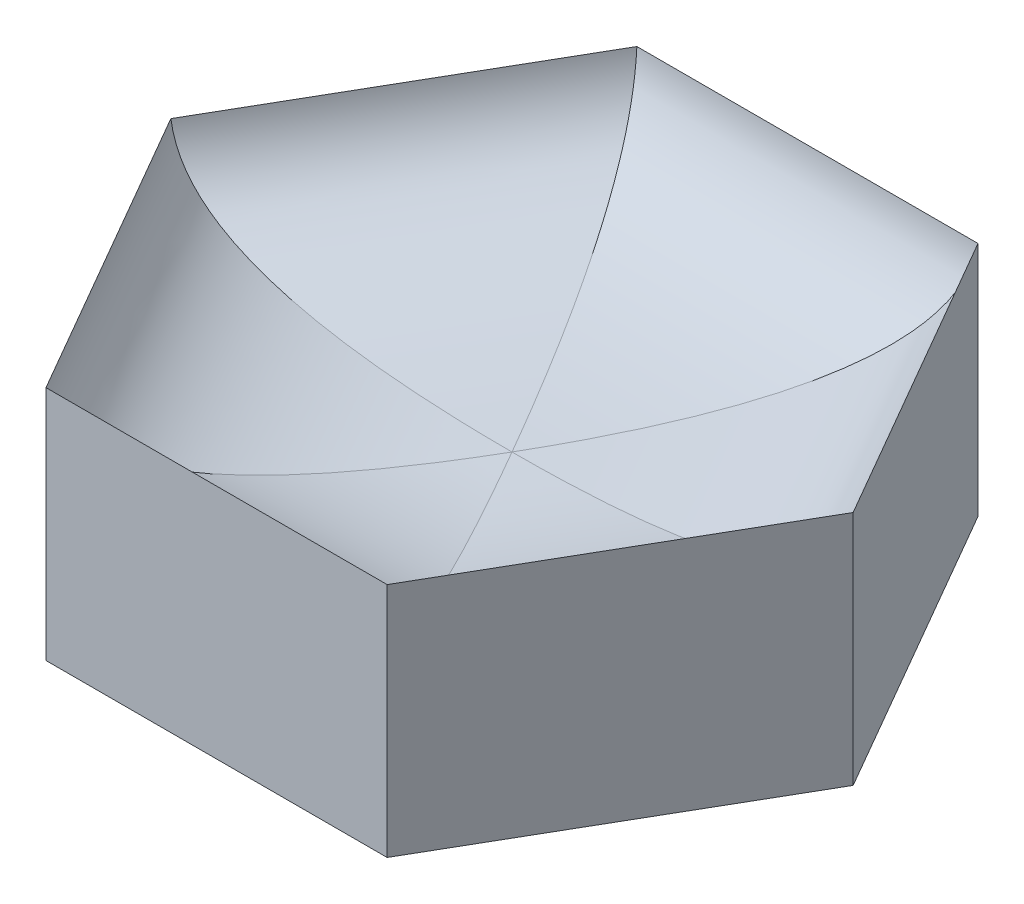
ISO-10303-21;
HEADER;
FILE_DESCRIPTION(('STEP AP214'),'2;1');
FILE_NAME('part.step','',(''),(''),'','','');
FILE_SCHEMA(('AUTOMOTIVE_DESIGN { 1 0 10303 214 1 1 1 1 }'));
ENDSEC;
DATA;
#1=APPLICATION_CONTEXT('core data for automotive mechanical design processes');
#2=APPLICATION_PROTOCOL_DEFINITION('international standard','automotive_design',2000,#1);
#3=PRODUCT_CONTEXT('',#1,'mechanical');
#4=PRODUCT('Part','Part','',(#3));
#5=PRODUCT_RELATED_PRODUCT_CATEGORY('part','',(#4));
#6=PRODUCT_DEFINITION_FORMATION('','',#4);
#7=PRODUCT_DEFINITION_CONTEXT('part definition',#1,'design');
#8=PRODUCT_DEFINITION('design','',#6,#7);
#9=PRODUCT_DEFINITION_SHAPE('','',#8);
#10=(LENGTH_UNIT() NAMED_UNIT(*) SI_UNIT(.MILLI.,.METRE.));
#11=(NAMED_UNIT(*) PLANE_ANGLE_UNIT() SI_UNIT($,.RADIAN.));
#12=(NAMED_UNIT(*) SI_UNIT($,.STERADIAN.) SOLID_ANGLE_UNIT());
#13=UNCERTAINTY_MEASURE_WITH_UNIT(LENGTH_MEASURE(1.E-05),#10,'distance_accuracy_value','');
#14=(GEOMETRIC_REPRESENTATION_CONTEXT(3) GLOBAL_UNCERTAINTY_ASSIGNED_CONTEXT((#13)) GLOBAL_UNIT_ASSIGNED_CONTEXT((#10,
#11,#12)) REPRESENTATION_CONTEXT('',''));
#15=CARTESIAN_POINT('',(0.,0.,0.));
#16=DIRECTION('',(0.,0.,1.));
#17=DIRECTION('',(1.,0.,0.));
#18=AXIS2_PLACEMENT_3D('',#15,#16,#17);
#19=CARTESIAN_POINT('',(28.8675134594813,40.,50.));
#20=DIRECTION('',(-0.866025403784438,0.,-0.5));
#21=DIRECTION('',(-0.5,0.,0.866025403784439));
#22=AXIS2_PLACEMENT_3D('',#19,#20,#21);
#23=PLANE('',#22);
#24=DIRECTION('',(0.5,0.,-0.866025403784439));
#25=VECTOR('',#24,1.);
#26=CARTESIAN_POINT('',(28.8675134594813,0.,50.));
#27=LINE('',#26,#25);
#28=CARTESIAN_POINT('',(28.8675134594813,0.,50.));
#29=VERTEX_POINT('',#28);
#30=CARTESIAN_POINT('',(57.7350269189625,0.,0.));
#31=VERTEX_POINT('',#30);
#32=EDGE_CURVE('E96',#29,#31,#27,.T.);
#33=ORIENTED_EDGE('',*,*,#32,.T.);
#34=DIRECTION('',(0.,-1.,0.));
#35=VECTOR('',#34,1.);
#36=CARTESIAN_POINT('',(57.7350269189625,40.,0.));
#37=LINE('',#36,#35);
#38=CARTESIAN_POINT('',(57.7350269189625,40.,0.));
#39=VERTEX_POINT('',#38);
#40=EDGE_CURVE('E11',#39,#31,#37,.T.);
#41=ORIENTED_EDGE('',*,*,#40,.F.);
#42=DIRECTION('',(0.5,0.,-0.866025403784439));
#43=VECTOR('',#42,1.);
#44=CARTESIAN_POINT('',(28.8675134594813,40.,50.));
#45=LINE('',#44,#43);
#46=CARTESIAN_POINT('',(28.8675134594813,40.,50.));
#47=VERTEX_POINT('',#46);
#48=EDGE_CURVE('E97',#47,#39,#45,.T.);
#49=ORIENTED_EDGE('',*,*,#48,.F.);
#50=DIRECTION('',(0.,-1.,0.));
#51=VECTOR('',#50,1.);
#52=CARTESIAN_POINT('',(28.8675134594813,40.,50.));
#53=LINE('',#52,#51);
#54=EDGE_CURVE('E91',#47,#29,#53,.T.);
#55=ORIENTED_EDGE('',*,*,#54,.T.);
#56=EDGE_LOOP('',(#33,#41,#49,#55));
#57=FACE_BOUND('',#56,.T.);
#58=ADVANCED_FACE('F32',(#57),#23,.F.);
#59=CARTESIAN_POINT('',(57.7350269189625,40.,0.));
#60=DIRECTION('',(-0.866025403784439,0.,0.5));
#61=DIRECTION('',(0.5,0.,0.866025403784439));
#62=AXIS2_PLACEMENT_3D('',#59,#60,#61);
#63=PLANE('',#62);
#64=DIRECTION('',(-0.5,0.,-0.866025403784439));
#65=VECTOR('',#64,1.);
#66=CARTESIAN_POINT('',(57.7350269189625,0.,0.));
#67=LINE('',#66,#65);
#68=CARTESIAN_POINT('',(28.8675134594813,0.,-50.));
#69=VERTEX_POINT('',#68);
#70=EDGE_CURVE('E121',#31,#69,#67,.T.);
#71=ORIENTED_EDGE('',*,*,#70,.T.);
#72=DIRECTION('',(0.,-1.,0.));
#73=VECTOR('',#72,1.);
#74=CARTESIAN_POINT('',(28.8675134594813,40.,-50.));
#75=LINE('',#74,#73);
#76=CARTESIAN_POINT('',(28.8675134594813,40.,-50.));
#77=VERTEX_POINT('',#76);
#78=EDGE_CURVE('E40',#77,#69,#75,.T.);
#79=ORIENTED_EDGE('',*,*,#78,.F.);
#80=DIRECTION('',(-0.5,0.,-0.866025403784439));
#81=VECTOR('',#80,1.);
#82=CARTESIAN_POINT('',(57.7350269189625,40.,0.));
#83=LINE('',#82,#81);
#84=EDGE_CURVE('E100',#39,#77,#83,.T.);
#85=ORIENTED_EDGE('',*,*,#84,.F.);
#86=ORIENTED_EDGE('',*,*,#40,.T.);
#87=EDGE_LOOP('',(#71,#79,#85,#86));
#88=FACE_BOUND('',#87,.T.);
#89=ADVANCED_FACE('F193',(#88),#63,.F.);
#90=CARTESIAN_POINT('',(28.8675134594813,40.,-50.));
#91=DIRECTION('',(0.,0.,1.));
#92=DIRECTION('',(1.,0.,0.));
#93=AXIS2_PLACEMENT_3D('',#90,#91,#92);
#94=PLANE('',#93);
#95=DIRECTION('',(-1.,0.,0.));
#96=VECTOR('',#95,1.);
#97=CARTESIAN_POINT('',(28.8675134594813,0.,-50.));
#98=LINE('',#97,#96);
#99=CARTESIAN_POINT('',(-28.8675134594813,0.,-50.));
#100=VERTEX_POINT('',#99);
#101=EDGE_CURVE('E115',#69,#100,#98,.T.);
#102=ORIENTED_EDGE('',*,*,#101,.T.);
#103=DIRECTION('',(0.,-1.,0.));
#104=VECTOR('',#103,1.);
#105=CARTESIAN_POINT('',(-28.8675134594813,40.,-50.));
#106=LINE('',#105,#104);
#107=CARTESIAN_POINT('',(-28.8675134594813,40.,-50.));
#108=VERTEX_POINT('',#107);
#109=EDGE_CURVE('E106',#108,#100,#106,.T.);
#110=ORIENTED_EDGE('',*,*,#109,.F.);
#111=DIRECTION('',(-1.,0.,0.));
#112=VECTOR('',#111,1.);
#113=CARTESIAN_POINT('',(28.8675134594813,40.,-50.));
#114=LINE('',#113,#112);
#115=EDGE_CURVE('E118',#77,#108,#114,.T.);
#116=ORIENTED_EDGE('',*,*,#115,.F.);
#117=ORIENTED_EDGE('',*,*,#78,.T.);
#118=EDGE_LOOP('',(#102,#110,#116,#117));
#119=FACE_BOUND('',#118,.T.);
#120=ADVANCED_FACE('F113',(#119),#94,.F.);
#121=CARTESIAN_POINT('',(-28.8675134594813,40.,-50.));
#122=DIRECTION('',(0.866025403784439,0.,0.5));
#123=DIRECTION('',(0.5,0.,-0.866025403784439));
#124=AXIS2_PLACEMENT_3D('',#121,#122,#123);
#125=PLANE('',#124);
#126=DIRECTION('',(-0.5,0.,0.866025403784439));
#127=VECTOR('',#126,1.);
#128=CARTESIAN_POINT('',(-28.8675134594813,0.,-50.));
#129=LINE('',#128,#127);
#130=CARTESIAN_POINT('',(-57.7350269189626,0.,0.));
#131=VERTEX_POINT('',#130);
#132=EDGE_CURVE('E83',#100,#131,#129,.T.);
#133=ORIENTED_EDGE('',*,*,#132,.T.);
#134=DIRECTION('',(0.,-1.,0.));
#135=VECTOR('',#134,1.);
#136=CARTESIAN_POINT('',(-57.7350269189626,40.,0.));
#137=LINE('',#136,#135);
#138=CARTESIAN_POINT('',(-57.7350269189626,40.,0.));
#139=VERTEX_POINT('',#138);
#140=EDGE_CURVE('E78',#139,#131,#137,.T.);
#141=ORIENTED_EDGE('',*,*,#140,.F.);
#142=DIRECTION('',(-0.5,0.,0.866025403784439));
#143=VECTOR('',#142,1.);
#144=CARTESIAN_POINT('',(-28.8675134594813,40.,-50.));
#145=LINE('',#144,#143);
#146=EDGE_CURVE('E129',#108,#139,#145,.T.);
#147=ORIENTED_EDGE('',*,*,#146,.F.);
#148=ORIENTED_EDGE('',*,*,#109,.T.);
#149=EDGE_LOOP('',(#133,#141,#147,#148));
#150=FACE_BOUND('',#149,.T.);
#151=ADVANCED_FACE('F207',(#150),#125,.F.);
#152=CARTESIAN_POINT('',(-57.7350269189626,40.,0.));
#153=DIRECTION('',(0.866025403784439,0.,-0.5));
#154=DIRECTION('',(-0.5,0.,-0.866025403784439));
#155=AXIS2_PLACEMENT_3D('',#152,#153,#154);
#156=PLANE('',#155);
#157=DIRECTION('',(0.5,0.,0.866025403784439));
#158=VECTOR('',#157,1.);
#159=CARTESIAN_POINT('',(-57.7350269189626,0.,0.));
#160=LINE('',#159,#158);
#161=CARTESIAN_POINT('',(-28.8675134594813,0.,50.));
#162=VERTEX_POINT('',#161);
#163=EDGE_CURVE('E72',#131,#162,#160,.T.);
#164=ORIENTED_EDGE('',*,*,#163,.T.);
#165=DIRECTION('',(0.,-1.,0.));
#166=VECTOR('',#165,1.);
#167=CARTESIAN_POINT('',(-28.8675134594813,40.,50.));
#168=LINE('',#167,#166);
#169=CARTESIAN_POINT('',(-28.8675134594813,40.,50.));
#170=VERTEX_POINT('',#169);
#171=EDGE_CURVE('E75',#170,#162,#168,.T.);
#172=ORIENTED_EDGE('',*,*,#171,.F.);
#173=DIRECTION('',(0.5,0.,0.866025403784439));
#174=VECTOR('',#173,1.);
#175=CARTESIAN_POINT('',(-57.7350269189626,40.,0.));
#176=LINE('',#175,#174);
#177=EDGE_CURVE('E47',#139,#170,#176,.T.);
#178=ORIENTED_EDGE('',*,*,#177,.F.);
#179=ORIENTED_EDGE('',*,*,#140,.T.);
#180=EDGE_LOOP('',(#164,#172,#178,#179));
#181=FACE_BOUND('',#180,.T.);
#182=ADVANCED_FACE('F74',(#181),#156,.F.);
#183=CARTESIAN_POINT('',(-28.8675134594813,40.,50.));
#184=DIRECTION('',(0.,0.,-1.));
#185=DIRECTION('',(-1.,0.,0.));
#186=AXIS2_PLACEMENT_3D('',#183,#184,#185);
#187=PLANE('',#186);
#188=DIRECTION('',(1.,0.,0.));
#189=VECTOR('',#188,1.);
#190=CARTESIAN_POINT('',(-28.8675134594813,0.,50.));
#191=LINE('',#190,#189);
#192=EDGE_CURVE('E82',#162,#29,#191,.T.);
#193=ORIENTED_EDGE('',*,*,#192,.T.);
#194=ORIENTED_EDGE('',*,*,#54,.F.);
#195=DIRECTION('',(1.,0.,0.));
#196=VECTOR('',#195,1.);
#197=CARTESIAN_POINT('',(-28.8675134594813,40.,50.));
#198=LINE('',#197,#196);
#199=EDGE_CURVE('E90',#170,#47,#198,.T.);
#200=ORIENTED_EDGE('',*,*,#199,.F.);
#201=ORIENTED_EDGE('',*,*,#171,.T.);
#202=EDGE_LOOP('',(#193,#194,#200,#201));
#203=FACE_BOUND('',#202,.T.);
#204=ADVANCED_FACE('F86',(#203),#187,.F.);
#205=CARTESIAN_POINT('',(57.7350269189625,0.,0.));
#206=DIRECTION('',(0.,1.,0.));
#207=DIRECTION('',(0.,0.,1.));
#208=AXIS2_PLACEMENT_3D('',#205,#206,#207);
#209=PLANE('',#208);
#210=ORIENTED_EDGE('',*,*,#32,.F.);
#211=ORIENTED_EDGE('',*,*,#192,.F.);
#212=ORIENTED_EDGE('',*,*,#163,.F.);
#213=ORIENTED_EDGE('',*,*,#132,.F.);
#214=ORIENTED_EDGE('',*,*,#101,.F.);
#215=ORIENTED_EDGE('',*,*,#70,.F.);
#216=EDGE_LOOP('',(#210,#211,#212,#213,#214,#215));
#217=FACE_BOUND('',#216,.T.);
#218=ADVANCED_FACE('F94',(#217),#209,.F.);
#219=CARTESIAN_POINT('',(-57.7350269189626,40.,0.));
#220=CARTESIAN_POINT('',(-54.8482755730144,20.,0.));
#221=CARTESIAN_POINT('',(0.,20.,0.));
#222=CARTESIAN_POINT('',(-28.8675134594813,40.,50.));
#223=CARTESIAN_POINT('',(-27.4241377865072,20.,47.5));
#224=CARTESIAN_POINT('',(0.,20.,0.));
#225=(BOUNDED_SURFACE() B_SPLINE_SURFACE(1,2,((#219,#220,#221),(#222,#223,#224)),.UNSPECIFIED.,
.F.,.F.,.F.) B_SPLINE_SURFACE_WITH_KNOTS((2,2),(3,3),(0.,1.),(0.,1.),
.UNSPECIFIED.) GEOMETRIC_REPRESENTATION_ITEM() RATIONAL_B_SPLINE_SURFACE(((1.,1.,1.),(1.,1.,1.))) REPRESENTATION_ITEM('') SURFACE());
#226=CARTESIAN_POINT('',(-28.8675134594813,40.,50.));
#227=CARTESIAN_POINT('',(-27.4241377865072,20.,47.5));
#228=CARTESIAN_POINT('',(0.,20.,0.));
#229=(BOUNDED_CURVE() B_SPLINE_CURVE(2,(#226,#227,#228),.UNSPECIFIED.,.F.,
.F.) B_SPLINE_CURVE_WITH_KNOTS((3,3),(0.,1.),
.UNSPECIFIED.) CURVE() GEOMETRIC_REPRESENTATION_ITEM() RATIONAL_B_SPLINE_CURVE((1.,1.,1.)) REPRESENTATION_ITEM(''));
#230=CARTESIAN_POINT('',(0.,20.,0.));
#231=VERTEX_POINT('',#230);
#232=EDGE_CURVE('E135',#170,#231,#229,.T.);
#233=CARTESIAN_POINT('',(-57.7350269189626,40.,0.));
#234=CARTESIAN_POINT('',(-54.8482755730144,20.,0.));
#235=CARTESIAN_POINT('',(0.,20.,0.));
#236=(BOUNDED_CURVE() B_SPLINE_CURVE(2,(#233,#234,#235),.UNSPECIFIED.,.F.,
.F.) B_SPLINE_CURVE_WITH_KNOTS((3,3),(0.,1.),
.UNSPECIFIED.) CURVE() GEOMETRIC_REPRESENTATION_ITEM() RATIONAL_B_SPLINE_CURVE((1.,1.,1.)) REPRESENTATION_ITEM(''));
#237=EDGE_CURVE('E139',#139,#231,#236,.T.);
#238=ORIENTED_EDGE('',*,*,#177,.T.);
#239=ORIENTED_EDGE('',*,*,#232,.T.);
#240=ORIENTED_EDGE('',*,*,#237,.F.);
#241=EDGE_LOOP('',(#238,#239,#240));
#242=FACE_BOUND('',#241,.T.);
#243=ADVANCED_FACE('F202',(#242),#225,.T.);
#244=CARTESIAN_POINT('',(-28.8675134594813,40.,-50.));
#245=CARTESIAN_POINT('',(-27.4241377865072,20.,-47.5));
#246=CARTESIAN_POINT('',(0.,20.,0.));
#247=CARTESIAN_POINT('',(-57.7350269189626,40.,0.));
#248=CARTESIAN_POINT('',(-54.8482755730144,20.,0.));
#249=CARTESIAN_POINT('',(0.,20.,0.));
#250=(BOUNDED_SURFACE() B_SPLINE_SURFACE(1,2,((#244,#245,#246),(#247,#248,#249)),.UNSPECIFIED.,
.F.,.F.,.F.) B_SPLINE_SURFACE_WITH_KNOTS((2,2),(3,3),(0.,1.),(0.,1.),
.UNSPECIFIED.) GEOMETRIC_REPRESENTATION_ITEM() RATIONAL_B_SPLINE_SURFACE(((1.,1.,1.),(1.,1.,1.))) REPRESENTATION_ITEM('') SURFACE());
#251=CARTESIAN_POINT('',(-28.8675134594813,40.,-50.));
#252=CARTESIAN_POINT('',(-27.4241377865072,20.,-47.5));
#253=CARTESIAN_POINT('',(0.,20.,0.));
#254=(BOUNDED_CURVE() B_SPLINE_CURVE(2,(#251,#252,#253),.UNSPECIFIED.,.F.,
.F.) B_SPLINE_CURVE_WITH_KNOTS((3,3),(0.,1.),
.UNSPECIFIED.) CURVE() GEOMETRIC_REPRESENTATION_ITEM() RATIONAL_B_SPLINE_CURVE((1.,1.,1.)) REPRESENTATION_ITEM(''));
#255=EDGE_CURVE('E147',#108,#231,#254,.T.);
#256=ORIENTED_EDGE('',*,*,#146,.T.);
#257=ORIENTED_EDGE('',*,*,#237,.T.);
#258=ORIENTED_EDGE('',*,*,#255,.F.);
#259=EDGE_LOOP('',(#256,#257,#258));
#260=FACE_BOUND('',#259,.T.);
#261=ADVANCED_FACE('F205',(#260),#250,.T.);
#262=CARTESIAN_POINT('',(28.8675134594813,40.,-50.));
#263=CARTESIAN_POINT('',(27.4241377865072,20.,-47.5));
#264=CARTESIAN_POINT('',(0.,20.,0.));
#265=CARTESIAN_POINT('',(-28.8675134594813,40.,-50.));
#266=CARTESIAN_POINT('',(-27.4241377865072,20.,-47.5));
#267=CARTESIAN_POINT('',(0.,20.,0.));
#268=(BOUNDED_SURFACE() B_SPLINE_SURFACE(1,2,((#262,#263,#264),(#265,#266,#267)),.UNSPECIFIED.,
.F.,.F.,.F.) B_SPLINE_SURFACE_WITH_KNOTS((2,2),(3,3),(0.,1.),(0.,1.),
.UNSPECIFIED.) GEOMETRIC_REPRESENTATION_ITEM() RATIONAL_B_SPLINE_SURFACE(((1.,1.,1.),(1.,1.,1.))) REPRESENTATION_ITEM('') SURFACE());
#269=CARTESIAN_POINT('',(28.8675134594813,40.,-50.));
#270=CARTESIAN_POINT('',(27.4241377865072,20.,-47.5));
#271=CARTESIAN_POINT('',(0.,20.,0.));
#272=(BOUNDED_CURVE() B_SPLINE_CURVE(2,(#269,#270,#271),.UNSPECIFIED.,.F.,
.F.) B_SPLINE_CURVE_WITH_KNOTS((3,3),(0.,1.),
.UNSPECIFIED.) CURVE() GEOMETRIC_REPRESENTATION_ITEM() RATIONAL_B_SPLINE_CURVE((1.,1.,1.)) REPRESENTATION_ITEM(''));
#273=EDGE_CURVE('E155',#77,#231,#272,.T.);
#274=ORIENTED_EDGE('',*,*,#115,.T.);
#275=ORIENTED_EDGE('',*,*,#255,.T.);
#276=ORIENTED_EDGE('',*,*,#273,.F.);
#277=EDGE_LOOP('',(#274,#275,#276));
#278=FACE_BOUND('',#277,.T.);
#279=ADVANCED_FACE('F263',(#278),#268,.T.);
#280=CARTESIAN_POINT('',(-28.8675134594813,40.,50.));
#281=CARTESIAN_POINT('',(-27.4241377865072,20.,47.5));
#282=CARTESIAN_POINT('',(0.,20.,0.));
#283=CARTESIAN_POINT('',(28.8675134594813,40.,50.));
#284=CARTESIAN_POINT('',(27.4241377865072,20.,47.5));
#285=CARTESIAN_POINT('',(0.,20.,0.));
#286=(BOUNDED_SURFACE() B_SPLINE_SURFACE(1,2,((#280,#281,#282),(#283,#284,#285)),.UNSPECIFIED.,
.F.,.F.,.F.) B_SPLINE_SURFACE_WITH_KNOTS((2,2),(3,3),(0.,1.),(0.,1.),
.UNSPECIFIED.) GEOMETRIC_REPRESENTATION_ITEM() RATIONAL_B_SPLINE_SURFACE(((1.,1.,1.),(1.,1.,1.))) REPRESENTATION_ITEM('') SURFACE());
#287=CARTESIAN_POINT('',(28.8675134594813,40.,50.));
#288=CARTESIAN_POINT('',(27.4241377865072,20.,47.5));
#289=CARTESIAN_POINT('',(0.,20.,0.));
#290=(BOUNDED_CURVE() B_SPLINE_CURVE(2,(#287,#288,#289),.UNSPECIFIED.,.F.,
.F.) B_SPLINE_CURVE_WITH_KNOTS((3,3),(0.,1.),
.UNSPECIFIED.) CURVE() GEOMETRIC_REPRESENTATION_ITEM() RATIONAL_B_SPLINE_CURVE((1.,1.,1.)) REPRESENTATION_ITEM(''));
#291=EDGE_CURVE('E163',#231,#47,#290,.F.);
#292=ORIENTED_EDGE('',*,*,#199,.T.);
#293=ORIENTED_EDGE('',*,*,#291,.F.);
#294=ORIENTED_EDGE('',*,*,#232,.F.);
#295=EDGE_LOOP('',(#292,#293,#294));
#296=FACE_BOUND('',#295,.T.);
#297=ADVANCED_FACE('F188',(#296),#286,.T.);
#298=CARTESIAN_POINT('',(57.7350269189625,40.,0.));
#299=CARTESIAN_POINT('',(54.8482755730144,20.,0.));
#300=CARTESIAN_POINT('',(0.,20.,0.));
#301=CARTESIAN_POINT('',(28.8675134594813,40.,-50.));
#302=CARTESIAN_POINT('',(27.4241377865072,20.,-47.5));
#303=CARTESIAN_POINT('',(0.,20.,0.));
#304=(BOUNDED_SURFACE() B_SPLINE_SURFACE(1,2,((#298,#299,#300),(#301,#302,#303)),.UNSPECIFIED.,
.F.,.F.,.F.) B_SPLINE_SURFACE_WITH_KNOTS((2,2),(3,3),(0.,1.),(0.,1.),
.UNSPECIFIED.) GEOMETRIC_REPRESENTATION_ITEM() RATIONAL_B_SPLINE_SURFACE(((1.,1.,1.),(1.,1.,1.))) REPRESENTATION_ITEM('') SURFACE());
#305=CARTESIAN_POINT('',(57.7350269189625,40.,0.));
#306=CARTESIAN_POINT('',(54.8482755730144,20.,0.));
#307=CARTESIAN_POINT('',(0.,20.,0.));
#308=(BOUNDED_CURVE() B_SPLINE_CURVE(2,(#305,#306,#307),.UNSPECIFIED.,.F.,
.F.) B_SPLINE_CURVE_WITH_KNOTS((3,3),(0.,1.),
.UNSPECIFIED.) CURVE() GEOMETRIC_REPRESENTATION_ITEM() RATIONAL_B_SPLINE_CURVE((1.,1.,1.)) REPRESENTATION_ITEM(''));
#309=EDGE_CURVE('E126',#39,#231,#308,.T.);
#310=ORIENTED_EDGE('',*,*,#84,.T.);
#311=ORIENTED_EDGE('',*,*,#273,.T.);
#312=ORIENTED_EDGE('',*,*,#309,.F.);
#313=EDGE_LOOP('',(#310,#311,#312));
#314=FACE_BOUND('',#313,.T.);
#315=ADVANCED_FACE('F194',(#314),#304,.T.);
#316=CARTESIAN_POINT('',(28.8675134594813,40.,50.));
#317=CARTESIAN_POINT('',(27.4241377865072,20.,47.5));
#318=CARTESIAN_POINT('',(0.,20.,0.));
#319=CARTESIAN_POINT('',(57.7350269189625,40.,0.));
#320=CARTESIAN_POINT('',(54.8482755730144,20.,0.));
#321=CARTESIAN_POINT('',(0.,20.,0.));
#322=(BOUNDED_SURFACE() B_SPLINE_SURFACE(1,2,((#316,#317,#318),(#319,#320,#321)),.UNSPECIFIED.,
.F.,.F.,.F.) B_SPLINE_SURFACE_WITH_KNOTS((2,2),(3,3),(0.,1.),(0.,1.),
.UNSPECIFIED.) GEOMETRIC_REPRESENTATION_ITEM() RATIONAL_B_SPLINE_SURFACE(((1.,1.,1.),(1.,1.,1.))) REPRESENTATION_ITEM('') SURFACE());
#323=ORIENTED_EDGE('',*,*,#48,.T.);
#324=ORIENTED_EDGE('',*,*,#309,.T.);
#325=ORIENTED_EDGE('',*,*,#291,.T.);
#326=EDGE_LOOP('',(#323,#324,#325));
#327=FACE_BOUND('',#326,.T.);
#328=ADVANCED_FACE('F183',(#327),#322,.T.);
#329=CLOSED_SHELL('',(#58,#89,#120,#151,#182,#204,#218,#243,#261,#279,#297,#315,#328));
#330=MANIFOLD_SOLID_BREP('B2',#329);
#331=ADVANCED_BREP_SHAPE_REPRESENTATION('',(#18,#330),#14);
#332=SHAPE_DEFINITION_REPRESENTATION(#9,#331);
ENDSEC;
END-ISO-10303-21;
